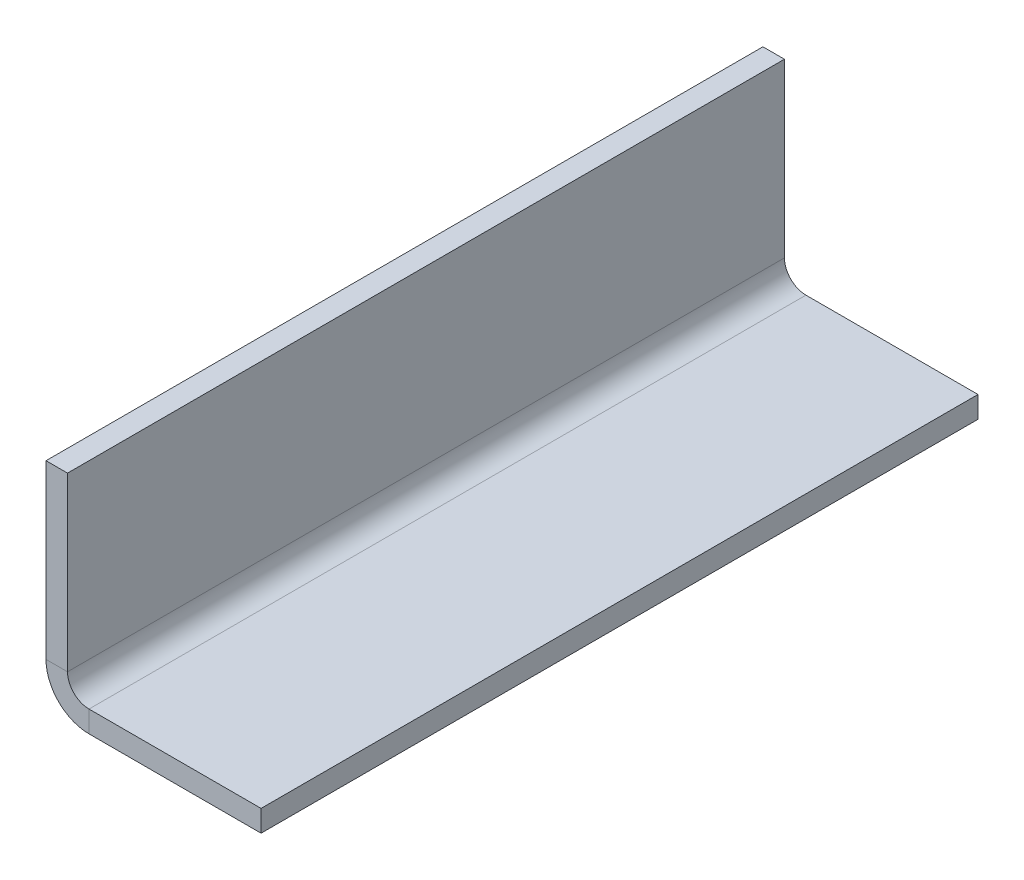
ISO-10303-21;
HEADER;
FILE_DESCRIPTION(('STEP AP214'),'2;1');
FILE_NAME('part.step','',(''),(''),'','','');
FILE_SCHEMA(('AUTOMOTIVE_DESIGN { 1 0 10303 214 1 1 1 1 }'));
ENDSEC;
DATA;
#1=APPLICATION_CONTEXT('core data for automotive mechanical design processes');
#2=APPLICATION_PROTOCOL_DEFINITION('international standard','automotive_design',2000,#1);
#3=PRODUCT_CONTEXT('',#1,'mechanical');
#4=PRODUCT('Part','Part','',(#3));
#5=PRODUCT_RELATED_PRODUCT_CATEGORY('part','',(#4));
#6=PRODUCT_DEFINITION_FORMATION('','',#4);
#7=PRODUCT_DEFINITION_CONTEXT('part definition',#1,'design');
#8=PRODUCT_DEFINITION('design','',#6,#7);
#9=PRODUCT_DEFINITION_SHAPE('','',#8);
#10=(LENGTH_UNIT() NAMED_UNIT(*) SI_UNIT(.MILLI.,.METRE.));
#11=(NAMED_UNIT(*) PLANE_ANGLE_UNIT() SI_UNIT($,.RADIAN.));
#12=(NAMED_UNIT(*) SI_UNIT($,.STERADIAN.) SOLID_ANGLE_UNIT());
#13=UNCERTAINTY_MEASURE_WITH_UNIT(LENGTH_MEASURE(1.E-05),#10,'distance_accuracy_value','');
#14=(GEOMETRIC_REPRESENTATION_CONTEXT(3) GLOBAL_UNCERTAINTY_ASSIGNED_CONTEXT((#13)) GLOBAL_UNIT_ASSIGNED_CONTEXT((#10,
#11,#12)) REPRESENTATION_CONTEXT('',''));
#15=CARTESIAN_POINT('',(0.,0.,0.));
#16=DIRECTION('',(0.,0.,1.));
#17=DIRECTION('',(1.,0.,0.));
#18=AXIS2_PLACEMENT_3D('',#15,#16,#17);
#19=CARTESIAN_POINT('',(0.,6.,50.));
#20=DIRECTION('',(0.,0.,1.));
#21=DIRECTION('',(1.,0.,0.));
#22=AXIS2_PLACEMENT_3D('',#19,#20,#21);
#23=PLANE('',#22);
#24=DIRECTION('',(1.,0.,0.));
#25=VECTOR('',#24,1.);
#26=CARTESIAN_POINT('',(0.,6.,50.));
#27=LINE('',#26,#25);
#28=CARTESIAN_POINT('',(0.,6.,50.));
#29=VERTEX_POINT('',#28);
#30=CARTESIAN_POINT('',(3.,6.,50.));
#31=VERTEX_POINT('',#30);
#32=EDGE_CURVE('E11',#29,#31,#27,.T.);
#33=ORIENTED_EDGE('',*,*,#32,.F.);
#34=CARTESIAN_POINT('',(6.,6.,50.));
#35=DIRECTION('',(0.,0.,-1.));
#36=DIRECTION('',(-1.,0.,0.));
#37=AXIS2_PLACEMENT_3D('',#34,#35,#36);
#38=CIRCLE('',#37,6.);
#39=CARTESIAN_POINT('',(6.,0.,50.));
#40=VERTEX_POINT('',#39);
#41=EDGE_CURVE('E124',#29,#40,#38,.F.);
#42=ORIENTED_EDGE('',*,*,#41,.T.);
#43=DIRECTION('',(0.,-1.,0.));
#44=VECTOR('',#43,1.);
#45=CARTESIAN_POINT('',(6.,3.,50.));
#46=LINE('',#45,#44);
#47=CARTESIAN_POINT('',(6.,3.,50.));
#48=VERTEX_POINT('',#47);
#49=EDGE_CURVE('E42',#48,#40,#46,.T.);
#50=ORIENTED_EDGE('',*,*,#49,.F.);
#51=CARTESIAN_POINT('',(6.,6.,50.));
#52=DIRECTION('',(0.,0.,1.));
#53=DIRECTION('',(1.,0.,0.));
#54=AXIS2_PLACEMENT_3D('',#51,#52,#53);
#55=CIRCLE('',#54,3.);
#56=EDGE_CURVE('E131',#31,#48,#55,.T.);
#57=ORIENTED_EDGE('',*,*,#56,.F.);
#58=EDGE_LOOP('',(#33,#42,#50,#57));
#59=FACE_BOUND('',#58,.T.);
#60=ADVANCED_FACE('F34',(#59),#23,.T.);
#61=CARTESIAN_POINT('',(6.,3.,50.));
#62=DIRECTION('',(0.,0.,1.));
#63=DIRECTION('',(1.,0.,0.));
#64=AXIS2_PLACEMENT_3D('',#61,#62,#63);
#65=PLANE('',#64);
#66=DIRECTION('',(0.,-1.,0.));
#67=VECTOR('',#66,1.);
#68=CARTESIAN_POINT('',(0.,30.,50.));
#69=LINE('',#68,#67);
#70=CARTESIAN_POINT('',(0.,30.,50.));
#71=VERTEX_POINT('',#70);
#72=EDGE_CURVE('E119',#71,#29,#69,.T.);
#73=ORIENTED_EDGE('',*,*,#72,.T.);
#74=ORIENTED_EDGE('',*,*,#32,.T.);
#75=DIRECTION('',(0.,-1.,0.));
#76=VECTOR('',#75,1.);
#77=CARTESIAN_POINT('',(3.,30.,50.));
#78=LINE('',#77,#76);
#79=CARTESIAN_POINT('',(3.,30.,50.));
#80=VERTEX_POINT('',#79);
#81=EDGE_CURVE('E129',#80,#31,#78,.T.);
#82=ORIENTED_EDGE('',*,*,#81,.F.);
#83=DIRECTION('',(1.,0.,0.));
#84=VECTOR('',#83,1.);
#85=CARTESIAN_POINT('',(0.,30.,50.));
#86=LINE('',#85,#84);
#87=EDGE_CURVE('E110',#71,#80,#86,.T.);
#88=ORIENTED_EDGE('',*,*,#87,.F.);
#89=EDGE_LOOP('',(#73,#74,#82,#88));
#90=FACE_BOUND('',#89,.T.);
#91=ADVANCED_FACE('F127',(#90),#65,.T.);
#92=CARTESIAN_POINT('',(6.,0.,-50.));
#93=DIRECTION('',(0.,0.,-1.));
#94=DIRECTION('',(-1.,0.,0.));
#95=AXIS2_PLACEMENT_3D('',#92,#93,#94);
#96=PLANE('',#95);
#97=DIRECTION('',(0.,1.,0.));
#98=VECTOR('',#97,1.);
#99=CARTESIAN_POINT('',(6.,0.,-50.));
#100=LINE('',#99,#98);
#101=CARTESIAN_POINT('',(6.,0.,-50.));
#102=VERTEX_POINT('',#101);
#103=CARTESIAN_POINT('',(6.,3.,-50.));
#104=VERTEX_POINT('',#103);
#105=EDGE_CURVE('E85',#102,#104,#100,.T.);
#106=ORIENTED_EDGE('',*,*,#105,.F.);
#107=CARTESIAN_POINT('',(6.,6.,-50.));
#108=DIRECTION('',(0.,0.,-1.));
#109=DIRECTION('',(-1.,0.,0.));
#110=AXIS2_PLACEMENT_3D('',#107,#108,#109);
#111=CIRCLE('',#110,6.);
#112=CARTESIAN_POINT('',(0.,6.,-50.));
#113=VERTEX_POINT('',#112);
#114=EDGE_CURVE('E153',#113,#102,#111,.F.);
#115=ORIENTED_EDGE('',*,*,#114,.F.);
#116=DIRECTION('',(-1.,0.,0.));
#117=VECTOR('',#116,1.);
#118=CARTESIAN_POINT('',(3.,6.,-50.));
#119=LINE('',#118,#117);
#120=CARTESIAN_POINT('',(3.,6.,-50.));
#121=VERTEX_POINT('',#120);
#122=EDGE_CURVE('E78',#121,#113,#119,.T.);
#123=ORIENTED_EDGE('',*,*,#122,.F.);
#124=CARTESIAN_POINT('',(6.,6.,-50.));
#125=DIRECTION('',(0.,0.,1.));
#126=DIRECTION('',(1.,0.,0.));
#127=AXIS2_PLACEMENT_3D('',#124,#125,#126);
#128=CIRCLE('',#127,3.);
#129=EDGE_CURVE('E146',#121,#104,#128,.T.);
#130=ORIENTED_EDGE('',*,*,#129,.T.);
#131=EDGE_LOOP('',(#106,#115,#123,#130));
#132=FACE_BOUND('',#131,.T.);
#133=ADVANCED_FACE('F185',(#132),#96,.T.);
#134=CARTESIAN_POINT('',(3.,6.,-50.));
#135=DIRECTION('',(0.,0.,-1.));
#136=DIRECTION('',(-1.,0.,0.));
#137=AXIS2_PLACEMENT_3D('',#134,#135,#136);
#138=PLANE('',#137);
#139=DIRECTION('',(1.,0.,0.));
#140=VECTOR('',#139,1.);
#141=CARTESIAN_POINT('',(0.,0.,-50.));
#142=LINE('',#141,#140);
#143=CARTESIAN_POINT('',(30.,0.,-50.));
#144=VERTEX_POINT('',#143);
#145=EDGE_CURVE('E137',#102,#144,#142,.T.);
#146=ORIENTED_EDGE('',*,*,#145,.F.);
#147=ORIENTED_EDGE('',*,*,#105,.T.);
#148=DIRECTION('',(1.,0.,0.));
#149=VECTOR('',#148,1.);
#150=CARTESIAN_POINT('',(0.,3.,-50.));
#151=LINE('',#150,#149);
#152=CARTESIAN_POINT('',(30.,3.,-50.));
#153=VERTEX_POINT('',#152);
#154=EDGE_CURVE('E143',#104,#153,#151,.T.);
#155=ORIENTED_EDGE('',*,*,#154,.T.);
#156=DIRECTION('',(0.,-1.,0.));
#157=VECTOR('',#156,1.);
#158=CARTESIAN_POINT('',(30.,3.,-50.));
#159=LINE('',#158,#157);
#160=EDGE_CURVE('E140',#153,#144,#159,.T.);
#161=ORIENTED_EDGE('',*,*,#160,.T.);
#162=EDGE_LOOP('',(#146,#147,#155,#161));
#163=FACE_BOUND('',#162,.T.);
#164=ADVANCED_FACE('F172',(#163),#138,.T.);
#165=CARTESIAN_POINT('',(0.,0.,50.));
#166=DIRECTION('',(0.,1.,0.));
#167=DIRECTION('',(0.,0.,1.));
#168=AXIS2_PLACEMENT_3D('',#165,#166,#167);
#169=PLANE('',#168);
#170=ORIENTED_EDGE('',*,*,#145,.T.);
#171=DIRECTION('',(0.,0.,-1.));
#172=VECTOR('',#171,1.);
#173=CARTESIAN_POINT('',(30.,0.,50.));
#174=LINE('',#173,#172);
#175=CARTESIAN_POINT('',(30.,0.,50.));
#176=VERTEX_POINT('',#175);
#177=EDGE_CURVE('E167',#176,#144,#174,.T.);
#178=ORIENTED_EDGE('',*,*,#177,.F.);
#179=DIRECTION('',(1.,0.,0.));
#180=VECTOR('',#179,1.);
#181=CARTESIAN_POINT('',(0.,0.,50.));
#182=LINE('',#181,#180);
#183=EDGE_CURVE('E91',#40,#176,#182,.T.);
#184=ORIENTED_EDGE('',*,*,#183,.F.);
#185=DIRECTION('',(0.,0.,-1.));
#186=VECTOR('',#185,1.);
#187=CARTESIAN_POINT('',(6.,0.,50.));
#188=LINE('',#187,#186);
#189=EDGE_CURVE('E136',#40,#102,#188,.T.);
#190=ORIENTED_EDGE('',*,*,#189,.T.);
#191=EDGE_LOOP('',(#170,#178,#184,#190));
#192=FACE_BOUND('',#191,.T.);
#193=ADVANCED_FACE('F221',(#192),#169,.F.);
#194=CARTESIAN_POINT('',(30.,3.,50.));
#195=DIRECTION('',(1.,0.,0.));
#196=DIRECTION('',(0.,0.,-1.));
#197=AXIS2_PLACEMENT_3D('',#194,#195,#196);
#198=PLANE('',#197);
#199=ORIENTED_EDGE('',*,*,#160,.F.);
#200=DIRECTION('',(0.,0.,-1.));
#201=VECTOR('',#200,1.);
#202=CARTESIAN_POINT('',(30.,3.,50.));
#203=LINE('',#202,#201);
#204=CARTESIAN_POINT('',(30.,3.,50.));
#205=VERTEX_POINT('',#204);
#206=EDGE_CURVE('E165',#205,#153,#203,.T.);
#207=ORIENTED_EDGE('',*,*,#206,.F.);
#208=DIRECTION('',(0.,-1.,0.));
#209=VECTOR('',#208,1.);
#210=CARTESIAN_POINT('',(30.,3.,50.));
#211=LINE('',#210,#209);
#212=EDGE_CURVE('E191',#205,#176,#211,.T.);
#213=ORIENTED_EDGE('',*,*,#212,.T.);
#214=ORIENTED_EDGE('',*,*,#177,.T.);
#215=EDGE_LOOP('',(#199,#207,#213,#214));
#216=FACE_BOUND('',#215,.T.);
#217=ADVANCED_FACE('F197',(#216),#198,.T.);
#218=CARTESIAN_POINT('',(0.,3.,50.));
#219=DIRECTION('',(0.,1.,0.));
#220=DIRECTION('',(0.,0.,1.));
#221=AXIS2_PLACEMENT_3D('',#218,#219,#220);
#222=PLANE('',#221);
#223=ORIENTED_EDGE('',*,*,#154,.F.);
#224=DIRECTION('',(0.,0.,-1.));
#225=VECTOR('',#224,1.);
#226=CARTESIAN_POINT('',(6.,3.,50.));
#227=LINE('',#226,#225);
#228=EDGE_CURVE('E162',#48,#104,#227,.T.);
#229=ORIENTED_EDGE('',*,*,#228,.F.);
#230=DIRECTION('',(1.,0.,0.));
#231=VECTOR('',#230,1.);
#232=CARTESIAN_POINT('',(0.,3.,50.));
#233=LINE('',#232,#231);
#234=EDGE_CURVE('E190',#48,#205,#233,.T.);
#235=ORIENTED_EDGE('',*,*,#234,.T.);
#236=ORIENTED_EDGE('',*,*,#206,.T.);
#237=EDGE_LOOP('',(#223,#229,#235,#236));
#238=FACE_BOUND('',#237,.T.);
#239=ADVANCED_FACE('F183',(#238),#222,.T.);
#240=CARTESIAN_POINT('',(6.,6.,50.));
#241=DIRECTION('',(0.,0.,-1.));
#242=DIRECTION('',(-1.,0.,0.));
#243=AXIS2_PLACEMENT_3D('',#240,#241,#242);
#244=CYLINDRICAL_SURFACE('',#243,3.);
#245=ORIENTED_EDGE('',*,*,#129,.F.);
#246=DIRECTION('',(0.,0.,-1.));
#247=VECTOR('',#246,1.);
#248=CARTESIAN_POINT('',(3.,6.,50.));
#249=LINE('',#248,#247);
#250=EDGE_CURVE('E159',#31,#121,#249,.T.);
#251=ORIENTED_EDGE('',*,*,#250,.F.);
#252=ORIENTED_EDGE('',*,*,#56,.T.);
#253=ORIENTED_EDGE('',*,*,#228,.T.);
#254=EDGE_LOOP('',(#245,#251,#252,#253));
#255=FACE_BOUND('',#254,.T.);
#256=ADVANCED_FACE('F178',(#255),#244,.F.);
#257=CARTESIAN_POINT('',(3.,30.,50.));
#258=DIRECTION('',(1.,0.,0.));
#259=DIRECTION('',(0.,1.,0.));
#260=AXIS2_PLACEMENT_3D('',#257,#258,#259);
#261=PLANE('',#260);
#262=DIRECTION('',(0.,-1.,0.));
#263=VECTOR('',#262,1.);
#264=CARTESIAN_POINT('',(3.,30.,-50.));
#265=LINE('',#264,#263);
#266=CARTESIAN_POINT('',(3.,30.,-50.));
#267=VERTEX_POINT('',#266);
#268=EDGE_CURVE('E148',#267,#121,#265,.T.);
#269=ORIENTED_EDGE('',*,*,#268,.F.);
#270=DIRECTION('',(0.,0.,-1.));
#271=VECTOR('',#270,1.);
#272=CARTESIAN_POINT('',(3.,30.,50.));
#273=LINE('',#272,#271);
#274=EDGE_CURVE('E114',#80,#267,#273,.T.);
#275=ORIENTED_EDGE('',*,*,#274,.F.);
#276=ORIENTED_EDGE('',*,*,#81,.T.);
#277=ORIENTED_EDGE('',*,*,#250,.T.);
#278=EDGE_LOOP('',(#269,#275,#276,#277));
#279=FACE_BOUND('',#278,.T.);
#280=ADVANCED_FACE('F188',(#279),#261,.T.);
#281=CARTESIAN_POINT('',(0.,30.,50.));
#282=DIRECTION('',(0.,1.,0.));
#283=DIRECTION('',(0.,0.,1.));
#284=AXIS2_PLACEMENT_3D('',#281,#282,#283);
#285=PLANE('',#284);
#286=DIRECTION('',(1.,0.,0.));
#287=VECTOR('',#286,1.);
#288=CARTESIAN_POINT('',(0.,30.,-50.));
#289=LINE('',#288,#287);
#290=CARTESIAN_POINT('',(0.,30.,-50.));
#291=VERTEX_POINT('',#290);
#292=EDGE_CURVE('E112',#291,#267,#289,.T.);
#293=ORIENTED_EDGE('',*,*,#292,.F.);
#294=DIRECTION('',(0.,0.,-1.));
#295=VECTOR('',#294,1.);
#296=CARTESIAN_POINT('',(0.,30.,50.));
#297=LINE('',#296,#295);
#298=EDGE_CURVE('E106',#71,#291,#297,.T.);
#299=ORIENTED_EDGE('',*,*,#298,.F.);
#300=ORIENTED_EDGE('',*,*,#87,.T.);
#301=ORIENTED_EDGE('',*,*,#274,.T.);
#302=EDGE_LOOP('',(#293,#299,#300,#301));
#303=FACE_BOUND('',#302,.T.);
#304=ADVANCED_FACE('F108',(#303),#285,.T.);
#305=CARTESIAN_POINT('',(0.,30.,50.));
#306=DIRECTION('',(1.,0.,0.));
#307=DIRECTION('',(0.,1.,0.));
#308=AXIS2_PLACEMENT_3D('',#305,#306,#307);
#309=PLANE('',#308);
#310=DIRECTION('',(0.,-1.,0.));
#311=VECTOR('',#310,1.);
#312=CARTESIAN_POINT('',(0.,30.,-50.));
#313=LINE('',#312,#311);
#314=EDGE_CURVE('E151',#291,#113,#313,.T.);
#315=ORIENTED_EDGE('',*,*,#314,.T.);
#316=DIRECTION('',(0.,0.,-1.));
#317=VECTOR('',#316,1.);
#318=CARTESIAN_POINT('',(0.,6.,50.));
#319=LINE('',#318,#317);
#320=EDGE_CURVE('E115',#29,#113,#319,.T.);
#321=ORIENTED_EDGE('',*,*,#320,.F.);
#322=ORIENTED_EDGE('',*,*,#72,.F.);
#323=ORIENTED_EDGE('',*,*,#298,.T.);
#324=EDGE_LOOP('',(#315,#321,#322,#323));
#325=FACE_BOUND('',#324,.T.);
#326=ADVANCED_FACE('F120',(#325),#309,.F.);
#327=CARTESIAN_POINT('',(6.,6.,50.));
#328=DIRECTION('',(0.,0.,-1.));
#329=DIRECTION('',(-1.,0.,0.));
#330=AXIS2_PLACEMENT_3D('',#327,#328,#329);
#331=CYLINDRICAL_SURFACE('',#330,6.);
#332=ORIENTED_EDGE('',*,*,#114,.T.);
#333=ORIENTED_EDGE('',*,*,#189,.F.);
#334=ORIENTED_EDGE('',*,*,#41,.F.);
#335=ORIENTED_EDGE('',*,*,#320,.T.);
#336=EDGE_LOOP('',(#332,#333,#334,#335));
#337=FACE_BOUND('',#336,.T.);
#338=ADVANCED_FACE('F201',(#337),#331,.T.);
#339=CARTESIAN_POINT('',(6.,6.,50.));
#340=DIRECTION('',(0.,0.,1.));
#341=DIRECTION('',(1.,0.,0.));
#342=AXIS2_PLACEMENT_3D('',#339,#340,#341);
#343=PLANE('',#342);
#344=ORIENTED_EDGE('',*,*,#183,.T.);
#345=ORIENTED_EDGE('',*,*,#212,.F.);
#346=ORIENTED_EDGE('',*,*,#234,.F.);
#347=ORIENTED_EDGE('',*,*,#49,.T.);
#348=EDGE_LOOP('',(#344,#345,#346,#347));
#349=FACE_BOUND('',#348,.T.);
#350=ADVANCED_FACE('F198',(#349),#343,.T.);
#351=CARTESIAN_POINT('',(6.,6.,-50.));
#352=DIRECTION('',(0.,0.,1.));
#353=DIRECTION('',(1.,0.,0.));
#354=AXIS2_PLACEMENT_3D('',#351,#352,#353);
#355=PLANE('',#354);
#356=ORIENTED_EDGE('',*,*,#268,.T.);
#357=ORIENTED_EDGE('',*,*,#122,.T.);
#358=ORIENTED_EDGE('',*,*,#314,.F.);
#359=ORIENTED_EDGE('',*,*,#292,.T.);
#360=EDGE_LOOP('',(#356,#357,#358,#359));
#361=FACE_BOUND('',#360,.T.);
#362=ADVANCED_FACE('F200',(#361),#355,.F.);
#363=CLOSED_SHELL('',(#60,#91,#133,#164,#193,#217,#239,#256,#280,#304,#326,#338,#350,#362));
#364=MANIFOLD_SOLID_BREP('B2',#363);
#365=ADVANCED_BREP_SHAPE_REPRESENTATION('',(#18,#364),#14);
#366=SHAPE_DEFINITION_REPRESENTATION(#9,#365);
ENDSEC;
END-ISO-10303-21;
